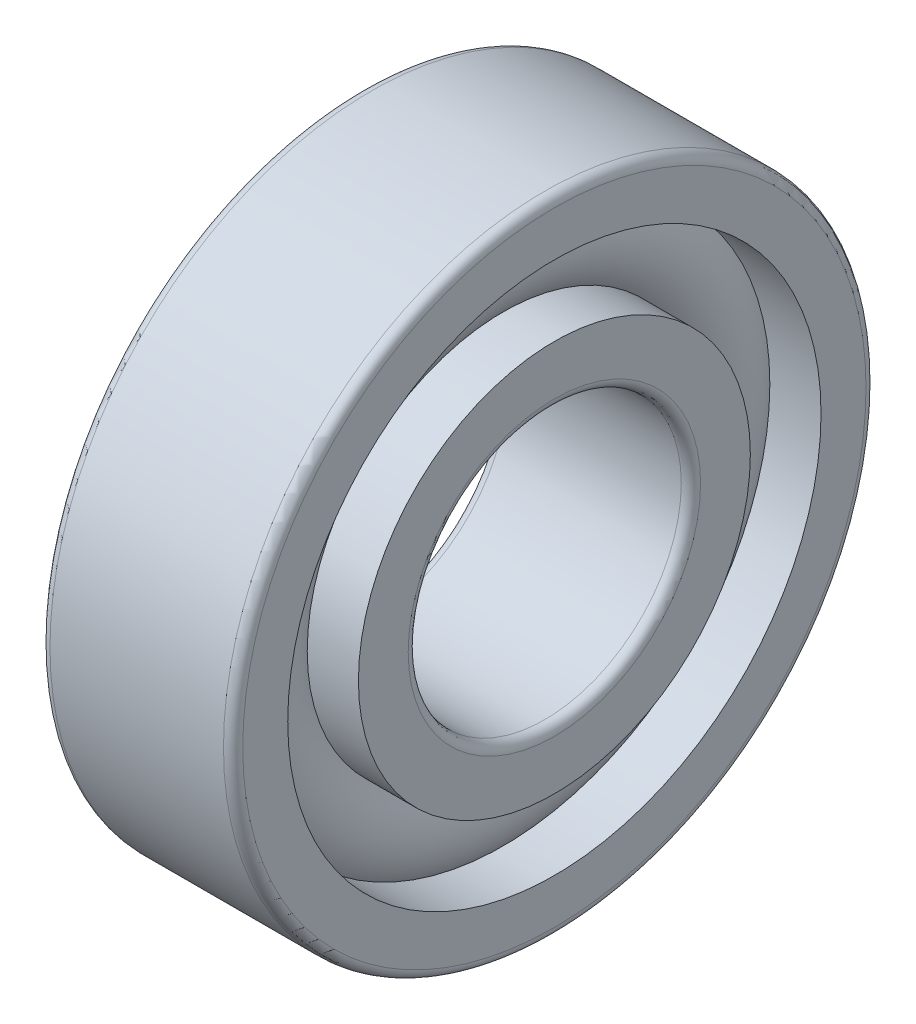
ISO-10303-21;
HEADER;
FILE_DESCRIPTION(('STEP AP214'),'2;1');
FILE_NAME('part.step','',(''),(''),'','','');
FILE_SCHEMA(('AUTOMOTIVE_DESIGN { 1 0 10303 214 1 1 1 1 }'));
ENDSEC;
DATA;
#1=APPLICATION_CONTEXT('core data for automotive mechanical design processes');
#2=APPLICATION_PROTOCOL_DEFINITION('international standard','automotive_design',2000,#1);
#3=PRODUCT_CONTEXT('',#1,'mechanical');
#4=PRODUCT('Part','Part','',(#3));
#5=PRODUCT_RELATED_PRODUCT_CATEGORY('part','',(#4));
#6=PRODUCT_DEFINITION_FORMATION('','',#4);
#7=PRODUCT_DEFINITION_CONTEXT('part definition',#1,'design');
#8=PRODUCT_DEFINITION('design','',#6,#7);
#9=PRODUCT_DEFINITION_SHAPE('','',#8);
#10=(LENGTH_UNIT() NAMED_UNIT(*) SI_UNIT(.MILLI.,.METRE.));
#11=(NAMED_UNIT(*) PLANE_ANGLE_UNIT() SI_UNIT($,.RADIAN.));
#12=(NAMED_UNIT(*) SI_UNIT($,.STERADIAN.) SOLID_ANGLE_UNIT());
#13=UNCERTAINTY_MEASURE_WITH_UNIT(LENGTH_MEASURE(1.E-05),#10,'distance_accuracy_value','');
#14=(GEOMETRIC_REPRESENTATION_CONTEXT(3) GLOBAL_UNCERTAINTY_ASSIGNED_CONTEXT((#13)) GLOBAL_UNIT_ASSIGNED_CONTEXT((#10,
#11,#12)) REPRESENTATION_CONTEXT('',''));
#15=CARTESIAN_POINT('',(0.,0.,0.));
#16=DIRECTION('',(0.,0.,1.));
#17=DIRECTION('',(1.,0.,0.));
#18=AXIS2_PLACEMENT_3D('',#15,#16,#17);
#19=CARTESIAN_POINT('',(1.97118869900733,0.,0.));
#20=DIRECTION('',(1.,0.,0.));
#21=DIRECTION('',(0.,0.,-1.));
#22=AXIS2_PLACEMENT_3D('',#19,#20,#21);
#23=TOROIDAL_SURFACE('',#22,16.7999999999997,0.199999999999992);
#24=CARTESIAN_POINT('',(1.77196728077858,0.,0.));
#25=DIRECTION('',(-1.,0.,0.));
#26=DIRECTION('',(0.,0.,1.));
#27=AXIS2_PLACEMENT_3D('',#24,#25,#26);
#28=CIRCLE('',#27,16.782369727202);
#29=CARTESIAN_POINT('',(1.77196728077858,0.,16.782369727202));
#30=VERTEX_POINT('',#29);
#31=EDGE_CURVE('E491',#30,#30,#28,.T.);
#32=ORIENTED_EDGE('',*,*,#31,.T.);
#33=EDGE_LOOP('',(#32));
#34=FACE_BOUND('',#33,.T.);
#35=CARTESIAN_POINT('',(1.9711883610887,0.,0.));
#36=DIRECTION('',(-1.,0.,0.));
#37=DIRECTION('',(0.,0.,1.));
#38=AXIS2_PLACEMENT_3D('',#35,#36,#37);
#39=CIRCLE('',#38,16.6);
#40=CARTESIAN_POINT('',(1.9711883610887,0.,16.6));
#41=VERTEX_POINT('',#40);
#42=EDGE_CURVE('E488',#41,#41,#39,.F.);
#43=ORIENTED_EDGE('',*,*,#42,.T.);
#44=EDGE_LOOP('',(#43));
#45=FACE_BOUND('',#44,.T.);
#46=ADVANCED_FACE('F14',(#34,#45),#23,.T.);
#47=CARTESIAN_POINT('',(1.742,0.,0.));
#48=DIRECTION('',(-1.,0.,0.));
#49=DIRECTION('',(0.,0.,1.));
#50=AXIS2_PLACEMENT_3D('',#47,#48,#49);
#51=CONICAL_SURFACE('',#50,17.121,1.48253068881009);
#52=CARTESIAN_POINT('',(1.742,0.,0.));
#53=DIRECTION('',(-1.,0.,0.));
#54=DIRECTION('',(0.,0.,1.));
#55=AXIS2_PLACEMENT_3D('',#52,#53,#54);
#56=CIRCLE('',#55,17.121);
#57=CARTESIAN_POINT('',(1.742,0.,17.121));
#58=VERTEX_POINT('',#57);
#59=EDGE_CURVE('E18',#58,#58,#56,.F.);
#60=ORIENTED_EDGE('',*,*,#59,.F.);
#61=EDGE_LOOP('',(#60));
#62=FACE_BOUND('',#61,.T.);
#63=ORIENTED_EDGE('',*,*,#31,.F.);
#64=EDGE_LOOP('',(#63));
#65=FACE_BOUND('',#64,.T.);
#66=ADVANCED_FACE('F426',(#62,#65),#51,.F.);
#67=CARTESIAN_POINT('',(11.4,0.,0.));
#68=DIRECTION('',(-1.,0.,0.));
#69=DIRECTION('',(0.,0.,1.));
#70=AXIS2_PLACEMENT_3D('',#67,#68,#69);
#71=CYLINDRICAL_SURFACE('',#70,16.6);
#72=ORIENTED_EDGE('',*,*,#42,.F.);
#73=EDGE_LOOP('',(#72));
#74=FACE_BOUND('',#73,.T.);
#75=CARTESIAN_POINT('',(3.186,0.,0.));
#76=DIRECTION('',(1.,0.,0.));
#77=DIRECTION('',(0.,0.,-1.));
#78=AXIS2_PLACEMENT_3D('',#75,#76,#77);
#79=CIRCLE('',#78,16.6);
#80=CARTESIAN_POINT('',(3.186,0.,-16.6));
#81=VERTEX_POINT('',#80);
#82=EDGE_CURVE('E411',#81,#81,#79,.F.);
#83=ORIENTED_EDGE('',*,*,#82,.F.);
#84=EDGE_LOOP('',(#83));
#85=FACE_BOUND('',#84,.T.);
#86=ADVANCED_FACE('F423',(#74,#85),#71,.F.);
#87=CARTESIAN_POINT('',(1.742,16.25,0.));
#88=DIRECTION('',(1.,0.,0.));
#89=DIRECTION('',(0.,0.,-1.));
#90=AXIS2_PLACEMENT_3D('',#87,#88,#89);
#91=PLANE('',#90);
#92=CARTESIAN_POINT('',(1.742,0.,0.));
#93=DIRECTION('',(1.,0.,0.));
#94=DIRECTION('',(0.,1.,0.));
#95=AXIS2_PLACEMENT_3D('',#92,#93,#94);
#96=CIRCLE('',#95,16.25);
#97=CARTESIAN_POINT('',(1.742,16.25,0.));
#98=VERTEX_POINT('',#97);
#99=EDGE_CURVE('E406',#98,#98,#96,.F.);
#100=ORIENTED_EDGE('',*,*,#99,.T.);
#101=EDGE_LOOP('',(#100));
#102=FACE_BOUND('',#101,.T.);
#103=ORIENTED_EDGE('',*,*,#59,.T.);
#104=EDGE_LOOP('',(#103));
#105=FACE_BOUND('',#104,.T.);
#106=ADVANCED_FACE('F419',(#102,#105),#91,.T.);
#107=CARTESIAN_POINT('',(6.0001044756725,0.,0.));
#108=DIRECTION('',(1.,0.,0.));
#109=DIRECTION('',(0.,0.,-1.));
#110=AXIS2_PLACEMENT_3D('',#107,#108,#109);
#111=TOROIDAL_SURFACE('',#110,14.4,3.572);
#112=ORIENTED_EDGE('',*,*,#82,.T.);
#113=EDGE_LOOP('',(#112));
#114=FACE_BOUND('',#113,.T.);
#115=CARTESIAN_POINT('',(3.186,0.,0.));
#116=DIRECTION('',(-1.,0.,0.));
#117=DIRECTION('',(0.,0.,1.));
#118=AXIS2_PLACEMENT_3D('',#115,#116,#117);
#119=CIRCLE('',#118,12.2);
#120=CARTESIAN_POINT('',(3.186,0.,12.2));
#121=VERTEX_POINT('',#120);
#122=EDGE_CURVE('E403',#121,#121,#119,.T.);
#123=ORIENTED_EDGE('',*,*,#122,.F.);
#124=EDGE_LOOP('',(#123));
#125=FACE_BOUND('',#124,.T.);
#126=ADVANCED_FACE('F414',(#114,#125),#111,.T.);
#127=CARTESIAN_POINT('',(1.742,0.,0.));
#128=DIRECTION('',(1.,0.,0.));
#129=DIRECTION('',(0.,1.,0.));
#130=AXIS2_PLACEMENT_3D('',#127,#128,#129);
#131=CONICAL_SURFACE('',#130,16.25,0.785398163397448);
#132=CARTESIAN_POINT('',(0.642,0.,0.));
#133=DIRECTION('',(1.,0.,0.));
#134=DIRECTION('',(0.,1.,0.));
#135=AXIS2_PLACEMENT_3D('',#132,#133,#134);
#136=CIRCLE('',#135,15.15);
#137=CARTESIAN_POINT('',(0.642,15.15,0.));
#138=VERTEX_POINT('',#137);
#139=EDGE_CURVE('E400',#138,#138,#136,.T.);
#140=ORIENTED_EDGE('',*,*,#139,.F.);
#141=EDGE_LOOP('',(#140));
#142=FACE_BOUND('',#141,.T.);
#143=ORIENTED_EDGE('',*,*,#99,.F.);
#144=EDGE_LOOP('',(#143));
#145=FACE_BOUND('',#144,.T.);
#146=ADVANCED_FACE('F418',(#142,#145),#131,.F.);
#147=CARTESIAN_POINT('',(11.4,0.,0.));
#148=DIRECTION('',(-1.,0.,0.));
#149=DIRECTION('',(0.,0.,1.));
#150=AXIS2_PLACEMENT_3D('',#147,#148,#149);
#151=CYLINDRICAL_SURFACE('',#150,12.2);
#152=ORIENTED_EDGE('',*,*,#122,.T.);
#153=EDGE_LOOP('',(#152));
#154=FACE_BOUND('',#153,.T.);
#155=CARTESIAN_POINT('',(1.94508565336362,0.,0.));
#156=DIRECTION('',(1.,0.,0.));
#157=DIRECTION('',(0.,0.,-1.));
#158=AXIS2_PLACEMENT_3D('',#155,#156,#157);
#159=CIRCLE('',#158,12.2000000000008);
#160=CARTESIAN_POINT('',(1.94508565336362,0.,-12.2000000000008));
#161=VERTEX_POINT('',#160);
#162=EDGE_CURVE('E396',#161,#161,#159,.F.);
#163=ORIENTED_EDGE('',*,*,#162,.F.);
#164=EDGE_LOOP('',(#163));
#165=FACE_BOUND('',#164,.T.);
#166=ADVANCED_FACE('F506',(#154,#165),#151,.T.);
#167=CARTESIAN_POINT('',(0.642,12.1,0.));
#168=DIRECTION('',(1.,0.,0.));
#169=DIRECTION('',(0.,0.,-1.));
#170=AXIS2_PLACEMENT_3D('',#167,#168,#169);
#171=PLANE('',#170);
#172=CARTESIAN_POINT('',(0.642,0.,0.));
#173=DIRECTION('',(-1.,0.,0.));
#174=DIRECTION('',(0.,0.,1.));
#175=AXIS2_PLACEMENT_3D('',#172,#173,#174);
#176=CIRCLE('',#175,12.1);
#177=CARTESIAN_POINT('',(0.642,0.,12.1));
#178=VERTEX_POINT('',#177);
#179=EDGE_CURVE('E399',#178,#178,#176,.F.);
#180=ORIENTED_EDGE('',*,*,#179,.F.);
#181=EDGE_LOOP('',(#180));
#182=FACE_BOUND('',#181,.T.);
#183=ORIENTED_EDGE('',*,*,#139,.T.);
#184=EDGE_LOOP('',(#183));
#185=FACE_BOUND('',#184,.T.);
#186=ADVANCED_FACE('F388',(#182,#185),#171,.T.);
#187=CARTESIAN_POINT('',(1.94508565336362,0.,0.));
#188=DIRECTION('',(1.,0.,0.));
#189=DIRECTION('',(0.,0.,-1.));
#190=AXIS2_PLACEMENT_3D('',#187,#188,#189);
#191=TOROIDAL_SURFACE('',#190,12.0000000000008,0.2);
#192=ORIENTED_EDGE('',*,*,#162,.T.);
#193=EDGE_LOOP('',(#192));
#194=FACE_BOUND('',#193,.T.);
#195=CARTESIAN_POINT('',(1.75715785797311,0.,0.));
#196=DIRECTION('',(1.,0.,0.));
#197=DIRECTION('',(0.,0.,-1.));
#198=AXIS2_PLACEMENT_3D('',#195,#196,#197);
#199=CIRCLE('',#198,12.0684334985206);
#200=CARTESIAN_POINT('',(1.75715785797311,0.,-12.0684334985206));
#201=VERTEX_POINT('',#200);
#202=EDGE_CURVE('E479',#201,#201,#199,.F.);
#203=ORIENTED_EDGE('',*,*,#202,.F.);
#204=EDGE_LOOP('',(#203));
#205=FACE_BOUND('',#204,.T.);
#206=ADVANCED_FACE('F383',(#194,#205),#191,.T.);
#207=CARTESIAN_POINT('',(11.4,0.,0.));
#208=DIRECTION('',(-1.,0.,0.));
#209=DIRECTION('',(0.,0.,1.));
#210=AXIS2_PLACEMENT_3D('',#207,#208,#209);
#211=CYLINDRICAL_SURFACE('',#210,12.1);
#212=CARTESIAN_POINT('',(1.162,0.,0.));
#213=DIRECTION('',(-1.,0.,0.));
#214=DIRECTION('',(0.,0.,1.));
#215=AXIS2_PLACEMENT_3D('',#212,#213,#214);
#216=CIRCLE('',#215,12.1);
#217=CARTESIAN_POINT('',(1.162,0.,12.1));
#218=VERTEX_POINT('',#217);
#219=EDGE_CURVE('E476',#218,#218,#216,.F.);
#220=ORIENTED_EDGE('',*,*,#219,.F.);
#221=EDGE_LOOP('',(#220));
#222=FACE_BOUND('',#221,.T.);
#223=ORIENTED_EDGE('',*,*,#179,.T.);
#224=EDGE_LOOP('',(#223));
#225=FACE_BOUND('',#224,.T.);
#226=ADVANCED_FACE('F379',(#222,#225),#211,.T.);
#227=CARTESIAN_POINT('',(1.75715785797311,0.,0.));
#228=DIRECTION('',(1.,0.,0.));
#229=DIRECTION('',(0.,1.,0.));
#230=AXIS2_PLACEMENT_3D('',#227,#228,#229);
#231=CONICAL_SURFACE('',#230,12.0684334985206,1.22157279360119);
#232=ORIENTED_EDGE('',*,*,#202,.T.);
#233=EDGE_LOOP('',(#232));
#234=FACE_BOUND('',#233,.T.);
#235=CARTESIAN_POINT('',(1.43420627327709,0.,0.));
#236=DIRECTION('',(1.,0.,0.));
#237=DIRECTION('',(0.,0.,-1.));
#238=AXIS2_PLACEMENT_3D('',#235,#236,#237);
#239=CIRCLE('',#238,11.1815664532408);
#240=CARTESIAN_POINT('',(1.43420627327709,0.,-11.1815664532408));
#241=VERTEX_POINT('',#240);
#242=EDGE_CURVE('E364',#241,#241,#239,.T.);
#243=ORIENTED_EDGE('',*,*,#242,.T.);
#244=EDGE_LOOP('',(#243));
#245=FACE_BOUND('',#244,.T.);
#246=ADVANCED_FACE('F375',(#234,#245),#231,.T.);
#247=CARTESIAN_POINT('',(1.162,11.8,0.));
#248=DIRECTION('',(1.,0.,0.));
#249=DIRECTION('',(0.,0.,-1.));
#250=AXIS2_PLACEMENT_3D('',#247,#248,#249);
#251=PLANE('',#250);
#252=CARTESIAN_POINT('',(1.162,0.,0.));
#253=DIRECTION('',(-1.,0.,0.));
#254=DIRECTION('',(0.,0.,1.));
#255=AXIS2_PLACEMENT_3D('',#252,#253,#254);
#256=CIRCLE('',#255,11.8);
#257=CARTESIAN_POINT('',(1.162,0.,11.8));
#258=VERTEX_POINT('',#257);
#259=EDGE_CURVE('E359',#258,#258,#256,.T.);
#260=ORIENTED_EDGE('',*,*,#259,.T.);
#261=EDGE_LOOP('',(#260));
#262=FACE_BOUND('',#261,.T.);
#263=ORIENTED_EDGE('',*,*,#219,.T.);
#264=EDGE_LOOP('',(#263));
#265=FACE_BOUND('',#264,.T.);
#266=ADVANCED_FACE('F371',(#262,#265),#251,.T.);
#267=CARTESIAN_POINT('',(1.24627849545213,0.,0.));
#268=DIRECTION('',(1.,0.,0.));
#269=DIRECTION('',(0.,0.,-1.));
#270=AXIS2_PLACEMENT_3D('',#267,#268,#269);
#271=TOROIDAL_SURFACE('',#270,11.249999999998,0.199999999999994);
#272=CARTESIAN_POINT('',(1.2462793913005,0.,0.));
#273=DIRECTION('',(-1.,0.,0.));
#274=DIRECTION('',(0.,0.,1.));
#275=AXIS2_PLACEMENT_3D('',#272,#273,#274);
#276=CIRCLE('',#275,11.05);
#277=CARTESIAN_POINT('',(1.2462793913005,0.,11.05));
#278=VERTEX_POINT('',#277);
#279=EDGE_CURVE('E346',#278,#278,#276,.T.);
#280=ORIENTED_EDGE('',*,*,#279,.F.);
#281=EDGE_LOOP('',(#280));
#282=FACE_BOUND('',#281,.T.);
#283=ORIENTED_EDGE('',*,*,#242,.F.);
#284=EDGE_LOOP('',(#283));
#285=FACE_BOUND('',#284,.T.);
#286=ADVANCED_FACE('F367',(#282,#285),#271,.F.);
#287=CARTESIAN_POINT('',(11.4,0.,0.));
#288=DIRECTION('',(-1.,0.,0.));
#289=DIRECTION('',(0.,0.,1.));
#290=AXIS2_PLACEMENT_3D('',#287,#288,#289);
#291=CYLINDRICAL_SURFACE('',#290,11.8);
#292=CARTESIAN_POINT('',(0.642,0.,0.));
#293=DIRECTION('',(1.,0.,0.));
#294=DIRECTION('',(0.,0.,-1.));
#295=AXIS2_PLACEMENT_3D('',#292,#293,#294);
#296=CIRCLE('',#295,11.8);
#297=CARTESIAN_POINT('',(0.642,0.,-11.8));
#298=VERTEX_POINT('',#297);
#299=EDGE_CURVE('E342',#298,#298,#296,.T.);
#300=ORIENTED_EDGE('',*,*,#299,.F.);
#301=EDGE_LOOP('',(#300));
#302=FACE_BOUND('',#301,.T.);
#303=ORIENTED_EDGE('',*,*,#259,.F.);
#304=EDGE_LOOP('',(#303));
#305=FACE_BOUND('',#304,.T.);
#306=ADVANCED_FACE('F370',(#302,#305),#291,.F.);
#307=CARTESIAN_POINT('',(11.4,0.,0.));
#308=DIRECTION('',(-1.,0.,0.));
#309=DIRECTION('',(0.,0.,1.));
#310=AXIS2_PLACEMENT_3D('',#307,#308,#309);
#311=CYLINDRICAL_SURFACE('',#310,11.05);
#312=ORIENTED_EDGE('',*,*,#279,.T.);
#313=EDGE_LOOP('',(#312));
#314=FACE_BOUND('',#313,.T.);
#315=CARTESIAN_POINT('',(1.071,0.,0.));
#316=DIRECTION('',(1.,0.,0.));
#317=DIRECTION('',(0.,0.,-1.));
#318=AXIS2_PLACEMENT_3D('',#315,#316,#317);
#319=CIRCLE('',#318,11.05);
#320=CARTESIAN_POINT('',(1.071,0.,-11.05));
#321=VERTEX_POINT('',#320);
#322=EDGE_CURVE('E345',#321,#321,#319,.T.);
#323=ORIENTED_EDGE('',*,*,#322,.T.);
#324=EDGE_LOOP('',(#323));
#325=FACE_BOUND('',#324,.T.);
#326=ADVANCED_FACE('F334',(#314,#325),#311,.T.);
#327=CARTESIAN_POINT('',(0.642,0.,0.));
#328=DIRECTION('',(1.,0.,0.));
#329=DIRECTION('',(0.,0.,-1.));
#330=AXIS2_PLACEMENT_3D('',#327,#328,#329);
#331=TOROIDAL_SURFACE('',#330,12.1,0.3);
#332=CARTESIAN_POINT('',(0.342,0.,0.));
#333=DIRECTION('',(-1.,0.,0.));
#334=DIRECTION('',(0.,0.,-1.));
#335=AXIS2_PLACEMENT_3D('',#332,#333,#334);
#336=CIRCLE('',#335,12.1);
#337=CARTESIAN_POINT('',(0.342,0.,-12.1));
#338=VERTEX_POINT('',#337);
#339=EDGE_CURVE('E299',#338,#338,#336,.F.);
#340=ORIENTED_EDGE('',*,*,#339,.F.);
#341=EDGE_LOOP('',(#340));
#342=FACE_BOUND('',#341,.T.);
#343=ORIENTED_EDGE('',*,*,#299,.T.);
#344=EDGE_LOOP('',(#343));
#345=FACE_BOUND('',#344,.T.);
#346=ADVANCED_FACE('F328',(#342,#345),#331,.T.);
#347=CARTESIAN_POINT('',(1.06984192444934,0.,0.));
#348=DIRECTION('',(1.,0.,0.));
#349=DIRECTION('',(0.,0.,-1.));
#350=AXIS2_PLACEMENT_3D('',#347,#348,#349);
#351=TOROIDAL_SURFACE('',#350,11.2499966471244,0.2);
#352=CARTESIAN_POINT('',(0.916429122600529,0.,0.));
#353=DIRECTION('',(-1.,0.,0.));
#354=DIRECTION('',(0.,0.,1.));
#355=AXIS2_PLACEMENT_3D('',#352,#353,#354);
#356=CIRCLE('',#355,11.1216825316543);
#357=CARTESIAN_POINT('',(0.91642912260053,0.,11.1216825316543));
#358=VERTEX_POINT('',#357);
#359=EDGE_CURVE('E296',#358,#358,#356,.T.);
#360=ORIENTED_EDGE('',*,*,#359,.F.);
#361=EDGE_LOOP('',(#360));
#362=FACE_BOUND('',#361,.T.);
#363=ORIENTED_EDGE('',*,*,#322,.F.);
#364=EDGE_LOOP('',(#363));
#365=FACE_BOUND('',#364,.T.);
#366=ADVANCED_FACE('F323',(#362,#365),#351,.F.);
#367=CARTESIAN_POINT('',(0.342,15.274,0.));
#368=DIRECTION('',(-1.,0.,0.));
#369=DIRECTION('',(0.,0.,1.));
#370=AXIS2_PLACEMENT_3D('',#367,#368,#369);
#371=PLANE('',#370);
#372=CARTESIAN_POINT('',(0.342,0.,0.));
#373=DIRECTION('',(1.,0.,0.));
#374=DIRECTION('',(0.,0.,-1.));
#375=AXIS2_PLACEMENT_3D('',#372,#373,#374);
#376=CIRCLE('',#375,15.274);
#377=CARTESIAN_POINT('',(0.342,0.,-15.274));
#378=VERTEX_POINT('',#377);
#379=EDGE_CURVE('E293',#378,#378,#376,.T.);
#380=ORIENTED_EDGE('',*,*,#379,.F.);
#381=EDGE_LOOP('',(#380));
#382=FACE_BOUND('',#381,.T.);
#383=ORIENTED_EDGE('',*,*,#339,.T.);
#384=EDGE_LOOP('',(#383));
#385=FACE_BOUND('',#384,.T.);
#386=ADVANCED_FACE('F312',(#382,#385),#371,.T.);
#387=CARTESIAN_POINT('',(0.600000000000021,0.,0.));
#388=DIRECTION('',(-1.,0.,0.));
#389=DIRECTION('',(0.,0.,1.));
#390=AXIS2_PLACEMENT_3D('',#387,#388,#389);
#391=CONICAL_SURFACE('',#390,11.5,0.874244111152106);
#392=ORIENTED_EDGE('',*,*,#359,.T.);
#393=EDGE_LOOP('',(#392));
#394=FACE_BOUND('',#393,.T.);
#395=CARTESIAN_POINT('',(0.6,0.,0.));
#396=DIRECTION('',(-1.,0.,0.));
#397=DIRECTION('',(0.,0.,1.));
#398=AXIS2_PLACEMENT_3D('',#395,#396,#397);
#399=CIRCLE('',#398,11.5);
#400=CARTESIAN_POINT('',(0.6,0.,11.5));
#401=VERTEX_POINT('',#400);
#402=EDGE_CURVE('E288',#401,#401,#399,.T.);
#403=ORIENTED_EDGE('',*,*,#402,.F.);
#404=EDGE_LOOP('',(#403));
#405=FACE_BOUND('',#404,.T.);
#406=ADVANCED_FACE('F322',(#394,#405),#391,.T.);
#407=CARTESIAN_POINT('',(1.442,0.,0.));
#408=DIRECTION('',(1.,0.,0.));
#409=DIRECTION('',(0.,0.,-1.));
#410=AXIS2_PLACEMENT_3D('',#407,#408,#409);
#411=CONICAL_SURFACE('',#410,16.374,0.785398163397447);
#412=CARTESIAN_POINT('',(1.442,0.,0.));
#413=DIRECTION('',(-1.,0.,0.));
#414=DIRECTION('',(0.,0.,1.));
#415=AXIS2_PLACEMENT_3D('',#412,#413,#414);
#416=CIRCLE('',#415,16.374);
#417=CARTESIAN_POINT('',(1.442,0.,16.374));
#418=VERTEX_POINT('',#417);
#419=EDGE_CURVE('E271',#418,#418,#416,.T.);
#420=ORIENTED_EDGE('',*,*,#419,.T.);
#421=EDGE_LOOP('',(#420));
#422=FACE_BOUND('',#421,.T.);
#423=ORIENTED_EDGE('',*,*,#379,.T.);
#424=EDGE_LOOP('',(#423));
#425=FACE_BOUND('',#424,.T.);
#426=ADVANCED_FACE('F684',(#422,#425),#411,.T.);
#427=CARTESIAN_POINT('',(11.4,0.,0.));
#428=DIRECTION('',(-1.,0.,0.));
#429=DIRECTION('',(0.,0.,1.));
#430=AXIS2_PLACEMENT_3D('',#427,#428,#429);
#431=CYLINDRICAL_SURFACE('',#430,11.5);
#432=ORIENTED_EDGE('',*,*,#402,.T.);
#433=EDGE_LOOP('',(#432));
#434=FACE_BOUND('',#433,.T.);
#435=CARTESIAN_POINT('',(0.2,0.,0.));
#436=DIRECTION('',(1.,0.,0.));
#437=DIRECTION('',(0.,0.,-1.));
#438=AXIS2_PLACEMENT_3D('',#435,#436,#437);
#439=CIRCLE('',#438,11.5);
#440=CARTESIAN_POINT('',(0.2,0.,-11.5));
#441=VERTEX_POINT('',#440);
#442=EDGE_CURVE('E268',#441,#441,#439,.F.);
#443=ORIENTED_EDGE('',*,*,#442,.F.);
#444=EDGE_LOOP('',(#443));
#445=FACE_BOUND('',#444,.T.);
#446=ADVANCED_FACE('F674',(#434,#445),#431,.T.);
#447=CARTESIAN_POINT('',(1.39199535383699,0.,0.));
#448=DIRECTION('',(-1.,0.,0.));
#449=DIRECTION('',(0.,0.,1.));
#450=AXIS2_PLACEMENT_3D('',#447,#448,#449);
#451=CONICAL_SURFACE('',#450,17.723125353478,1.53374879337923);
#452=CARTESIAN_POINT('',(1.39199535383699,0.,0.));
#453=DIRECTION('',(1.,0.,0.));
#454=DIRECTION('',(0.,0.,-1.));
#455=AXIS2_PLACEMENT_3D('',#452,#453,#454);
#456=CIRCLE('',#455,17.723125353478);
#457=CARTESIAN_POINT('',(1.39199535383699,0.,-17.723125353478));
#458=VERTEX_POINT('',#457);
#459=EDGE_CURVE('E247',#458,#458,#456,.F.);
#460=ORIENTED_EDGE('',*,*,#459,.T.);
#461=EDGE_LOOP('',(#460));
#462=FACE_BOUND('',#461,.T.);
#463=ORIENTED_EDGE('',*,*,#419,.F.);
#464=EDGE_LOOP('',(#463));
#465=FACE_BOUND('',#464,.T.);
#466=ADVANCED_FACE('F261',(#462,#465),#451,.F.);
#467=CARTESIAN_POINT('',(0.2,0.,0.));
#468=DIRECTION('',(1.,0.,0.));
#469=DIRECTION('',(0.,0.,-1.));
#470=AXIS2_PLACEMENT_3D('',#467,#468,#469);
#471=TOROIDAL_SURFACE('',#470,11.3,0.2);
#472=ORIENTED_EDGE('',*,*,#442,.T.);
#473=EDGE_LOOP('',(#472));
#474=FACE_BOUND('',#473,.T.);
#475=CARTESIAN_POINT('',(0.,0.,0.));
#476=DIRECTION('',(1.,0.,0.));
#477=DIRECTION('',(0.,0.,-1.));
#478=AXIS2_PLACEMENT_3D('',#475,#476,#477);
#479=CIRCLE('',#478,11.3);
#480=CARTESIAN_POINT('',(0.,0.,-11.3));
#481=VERTEX_POINT('',#480);
#482=EDGE_CURVE('E277',#481,#481,#479,.F.);
#483=ORIENTED_EDGE('',*,*,#482,.F.);
#484=EDGE_LOOP('',(#483));
#485=FACE_BOUND('',#484,.T.);
#486=ADVANCED_FACE('F254',(#474,#485),#471,.T.);
#487=CARTESIAN_POINT('',(1.19213266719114,0.,0.));
#488=DIRECTION('',(1.,0.,0.));
#489=DIRECTION('',(0.,0.,-1.));
#490=AXIS2_PLACEMENT_3D('',#487,#488,#489);
#491=TOROIDAL_SURFACE('',#490,17.7157154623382,0.2);
#492=ORIENTED_EDGE('',*,*,#459,.F.);
#493=EDGE_LOOP('',(#492));
#494=FACE_BOUND('',#493,.T.);
#495=CARTESIAN_POINT('',(1.0284021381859,0.,0.));
#496=DIRECTION('',(1.,0.,0.));
#497=DIRECTION('',(0.,0.,-1.));
#498=AXIS2_PLACEMENT_3D('',#495,#496,#497);
#499=CIRCLE('',#498,17.8305732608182);
#500=CARTESIAN_POINT('',(1.0284021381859,0.,-17.8305732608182));
#501=VERTEX_POINT('',#500);
#502=EDGE_CURVE('E221',#501,#501,#499,.F.);
#503=ORIENTED_EDGE('',*,*,#502,.T.);
#504=EDGE_LOOP('',(#503));
#505=FACE_BOUND('',#504,.T.);
#506=ADVANCED_FACE('F250',(#494,#505),#491,.F.);
#507=CARTESIAN_POINT('',(0.,11.3,0.));
#508=DIRECTION('',(-1.,0.,0.));
#509=DIRECTION('',(0.,0.,1.));
#510=AXIS2_PLACEMENT_3D('',#507,#508,#509);
#511=PLANE('',#510);
#512=ORIENTED_EDGE('',*,*,#482,.T.);
#513=EDGE_LOOP('',(#512));
#514=FACE_BOUND('',#513,.T.);
#515=CARTESIAN_POINT('',(0.,0.,0.));
#516=DIRECTION('',(-1.,0.,0.));
#517=DIRECTION('',(0.,0.,-1.));
#518=AXIS2_PLACEMENT_3D('',#515,#516,#517);
#519=CIRCLE('',#518,9.1);
#520=CARTESIAN_POINT('',(0.,0.,-9.1));
#521=VERTEX_POINT('',#520);
#522=EDGE_CURVE('E216',#521,#521,#519,.T.);
#523=ORIENTED_EDGE('',*,*,#522,.F.);
#524=EDGE_LOOP('',(#523));
#525=FACE_BOUND('',#524,.T.);
#526=ADVANCED_FACE('F253',(#514,#525),#511,.T.);
#527=CARTESIAN_POINT('',(1.0284021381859,0.,0.));
#528=DIRECTION('',(1.,0.,0.));
#529=DIRECTION('',(0.,0.,-1.));
#530=AXIS2_PLACEMENT_3D('',#527,#528,#529);
#531=CONICAL_SURFACE('',#530,17.8305732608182,0.959069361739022);
#532=CARTESIAN_POINT('',(0.746,0.,0.));
#533=DIRECTION('',(-1.,0.,0.));
#534=DIRECTION('',(0.,0.,1.));
#535=AXIS2_PLACEMENT_3D('',#532,#533,#534);
#536=CIRCLE('',#535,17.428);
#537=CARTESIAN_POINT('',(0.745999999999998,0.,17.428));
#538=VERTEX_POINT('',#537);
#539=EDGE_CURVE('E211',#538,#538,#536,.F.);
#540=ORIENTED_EDGE('',*,*,#539,.F.);
#541=EDGE_LOOP('',(#540));
#542=FACE_BOUND('',#541,.T.);
#543=ORIENTED_EDGE('',*,*,#502,.F.);
#544=EDGE_LOOP('',(#543));
#545=FACE_BOUND('',#544,.T.);
#546=ADVANCED_FACE('F230',(#542,#545),#531,.F.);
#547=CARTESIAN_POINT('',(0.6,0.,0.));
#548=DIRECTION('',(1.,0.,0.));
#549=DIRECTION('',(0.,0.,-1.));
#550=AXIS2_PLACEMENT_3D('',#547,#548,#549);
#551=TOROIDAL_SURFACE('',#550,9.1,0.6);
#552=ORIENTED_EDGE('',*,*,#522,.T.);
#553=EDGE_LOOP('',(#552));
#554=FACE_BOUND('',#553,.T.);
#555=CARTESIAN_POINT('',(0.6,0.,0.));
#556=DIRECTION('',(-1.,0.,0.));
#557=DIRECTION('',(0.,0.,1.));
#558=AXIS2_PLACEMENT_3D('',#555,#556,#557);
#559=CIRCLE('',#558,8.5);
#560=CARTESIAN_POINT('',(0.6,0.,8.5));
#561=VERTEX_POINT('',#560);
#562=EDGE_CURVE('E206',#561,#561,#559,.F.);
#563=ORIENTED_EDGE('',*,*,#562,.T.);
#564=EDGE_LOOP('',(#563));
#565=FACE_BOUND('',#564,.T.);
#566=ADVANCED_FACE('F224',(#554,#565),#551,.T.);
#567=CARTESIAN_POINT('',(0.746,0.,0.));
#568=DIRECTION('',(-1.,0.,0.));
#569=DIRECTION('',(0.,-1.,0.));
#570=AXIS2_PLACEMENT_3D('',#567,#568,#569);
#571=CONICAL_SURFACE('',#570,17.428,0.614823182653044);
#572=CARTESIAN_POINT('',(0.991,0.,0.));
#573=DIRECTION('',(1.,0.,0.));
#574=DIRECTION('',(0.,0.,-1.));
#575=AXIS2_PLACEMENT_3D('',#572,#573,#574);
#576=CIRCLE('',#575,17.255);
#577=CARTESIAN_POINT('',(0.991,0.,-17.255));
#578=VERTEX_POINT('',#577);
#579=EDGE_CURVE('E198',#578,#578,#576,.F.);
#580=ORIENTED_EDGE('',*,*,#579,.T.);
#581=EDGE_LOOP('',(#580));
#582=FACE_BOUND('',#581,.T.);
#583=ORIENTED_EDGE('',*,*,#539,.T.);
#584=EDGE_LOOP('',(#583));
#585=FACE_BOUND('',#584,.T.);
#586=ADVANCED_FACE('F229',(#582,#585),#571,.T.);
#587=CARTESIAN_POINT('',(11.4,0.,0.));
#588=DIRECTION('',(-1.,0.,0.));
#589=DIRECTION('',(0.,0.,1.));
#590=AXIS2_PLACEMENT_3D('',#587,#588,#589);
#591=CYLINDRICAL_SURFACE('',#590,8.5);
#592=ORIENTED_EDGE('',*,*,#562,.F.);
#593=EDGE_LOOP('',(#592));
#594=FACE_BOUND('',#593,.T.);
#595=CARTESIAN_POINT('',(11.4,0.,0.));
#596=DIRECTION('',(1.,0.,0.));
#597=DIRECTION('',(0.,0.,-1.));
#598=AXIS2_PLACEMENT_3D('',#595,#596,#597);
#599=CIRCLE('',#598,8.5);
#600=CARTESIAN_POINT('',(11.4,0.,-8.5));
#601=VERTEX_POINT('',#600);
#602=EDGE_CURVE('E179',#601,#601,#599,.F.);
#603=ORIENTED_EDGE('',*,*,#602,.F.);
#604=EDGE_LOOP('',(#603));
#605=FACE_BOUND('',#604,.T.);
#606=ADVANCED_FACE('F609',(#594,#605),#591,.F.);
#607=CARTESIAN_POINT('',(0.991,0.,0.));
#608=DIRECTION('',(1.,0.,0.));
#609=DIRECTION('',(0.,0.,-1.));
#610=AXIS2_PLACEMENT_3D('',#607,#608,#609);
#611=CONICAL_SURFACE('',#610,17.255,0.958701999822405);
#612=CARTESIAN_POINT('',(0.819,0.,0.));
#613=DIRECTION('',(-1.,0.,0.));
#614=DIRECTION('',(0.,0.,1.));
#615=AXIS2_PLACEMENT_3D('',#612,#613,#614);
#616=CIRCLE('',#615,17.01);
#617=CARTESIAN_POINT('',(0.818999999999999,0.,17.01));
#618=VERTEX_POINT('',#617);
#619=EDGE_CURVE('E170',#618,#618,#616,.T.);
#620=ORIENTED_EDGE('',*,*,#619,.T.);
#621=EDGE_LOOP('',(#620));
#622=FACE_BOUND('',#621,.T.);
#623=ORIENTED_EDGE('',*,*,#579,.F.);
#624=EDGE_LOOP('',(#623));
#625=FACE_BOUND('',#624,.T.);
#626=ADVANCED_FACE('F189',(#622,#625),#611,.F.);
#627=CARTESIAN_POINT('',(11.4,0.,0.));
#628=DIRECTION('',(1.,0.,0.));
#629=DIRECTION('',(0.,0.,-1.));
#630=AXIS2_PLACEMENT_3D('',#627,#628,#629);
#631=TOROIDAL_SURFACE('',#630,9.1,0.6);
#632=ORIENTED_EDGE('',*,*,#602,.T.);
#633=EDGE_LOOP('',(#632));
#634=FACE_BOUND('',#633,.T.);
#635=CARTESIAN_POINT('',(12.,0.,0.));
#636=DIRECTION('',(1.,0.,0.));
#637=DIRECTION('',(0.,0.,-1.));
#638=AXIS2_PLACEMENT_3D('',#635,#636,#637);
#639=CIRCLE('',#638,9.1);
#640=CARTESIAN_POINT('',(12.,0.,-9.1));
#641=VERTEX_POINT('',#640);
#642=EDGE_CURVE('E178',#641,#641,#639,.F.);
#643=ORIENTED_EDGE('',*,*,#642,.F.);
#644=EDGE_LOOP('',(#643));
#645=FACE_BOUND('',#644,.T.);
#646=ADVANCED_FACE('F185',(#634,#645),#631,.T.);
#647=CARTESIAN_POINT('',(0.573534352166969,0.,0.));
#648=DIRECTION('',(-1.,0.,0.));
#649=DIRECTION('',(0.,-1.,0.));
#650=AXIS2_PLACEMENT_3D('',#647,#648,#649);
#651=CONICAL_SURFACE('',#650,17.1816263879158,0.610180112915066);
#652=CARTESIAN_POINT('',(0.573534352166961,0.,0.));
#653=DIRECTION('',(1.,0.,0.));
#654=DIRECTION('',(0.,0.,-1.));
#655=AXIS2_PLACEMENT_3D('',#652,#653,#654);
#656=CIRCLE('',#655,17.1816263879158);
#657=CARTESIAN_POINT('',(0.573534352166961,0.,-17.1816263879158));
#658=VERTEX_POINT('',#657);
#659=EDGE_CURVE('E148',#658,#658,#656,.T.);
#660=ORIENTED_EDGE('',*,*,#659,.F.);
#661=EDGE_LOOP('',(#660));
#662=FACE_BOUND('',#661,.T.);
#663=ORIENTED_EDGE('',*,*,#619,.F.);
#664=EDGE_LOOP('',(#663));
#665=FACE_BOUND('',#664,.T.);
#666=ADVANCED_FACE('F161',(#662,#665),#651,.F.);
#667=CARTESIAN_POINT('',(12.,9.1,0.));
#668=DIRECTION('',(1.,0.,0.));
#669=DIRECTION('',(0.,0.,-1.));
#670=AXIS2_PLACEMENT_3D('',#667,#668,#669);
#671=PLANE('',#670);
#672=ORIENTED_EDGE('',*,*,#642,.T.);
#673=EDGE_LOOP('',(#672));
#674=FACE_BOUND('',#673,.T.);
#675=CARTESIAN_POINT('',(12.,0.,0.));
#676=DIRECTION('',(-1.,0.,0.));
#677=DIRECTION('',(0.,0.,1.));
#678=AXIS2_PLACEMENT_3D('',#675,#676,#677);
#679=CIRCLE('',#678,12.2);
#680=CARTESIAN_POINT('',(12.,0.,12.2));
#681=VERTEX_POINT('',#680);
#682=EDGE_CURVE('E143',#681,#681,#679,.T.);
#683=ORIENTED_EDGE('',*,*,#682,.F.);
#684=EDGE_LOOP('',(#683));
#685=FACE_BOUND('',#684,.T.);
#686=ADVANCED_FACE('F156',(#674,#685),#671,.T.);
#687=CARTESIAN_POINT('',(0.745438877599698,0.,0.));
#688=DIRECTION('',(1.,0.,0.));
#689=DIRECTION('',(0.,0.,-1.));
#690=AXIS2_PLACEMENT_3D('',#687,#688,#689);
#691=TOROIDAL_SURFACE('',#690,17.4274898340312,0.3);
#692=CARTESIAN_POINT('',(0.499999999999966,0.,0.));
#693=DIRECTION('',(-1.,0.,0.));
#694=DIRECTION('',(0.,0.,1.));
#695=AXIS2_PLACEMENT_3D('',#692,#693,#694);
#696=CIRCLE('',#695,17.6);
#697=CARTESIAN_POINT('',(0.499999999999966,0.,17.6));
#698=VERTEX_POINT('',#697);
#699=EDGE_CURVE('E138',#698,#698,#696,.T.);
#700=ORIENTED_EDGE('',*,*,#699,.T.);
#701=EDGE_LOOP('',(#700));
#702=FACE_BOUND('',#701,.T.);
#703=ORIENTED_EDGE('',*,*,#659,.T.);
#704=EDGE_LOOP('',(#703));
#705=FACE_BOUND('',#704,.T.);
#706=ADVANCED_FACE('F151',(#702,#705),#691,.T.);
#707=CARTESIAN_POINT('',(11.4,0.,0.));
#708=DIRECTION('',(-1.,0.,0.));
#709=DIRECTION('',(0.,0.,1.));
#710=AXIS2_PLACEMENT_3D('',#707,#708,#709);
#711=CYLINDRICAL_SURFACE('',#710,12.2);
#712=ORIENTED_EDGE('',*,*,#682,.T.);
#713=EDGE_LOOP('',(#712));
#714=FACE_BOUND('',#713,.T.);
#715=CARTESIAN_POINT('',(8.814,0.,0.));
#716=DIRECTION('',(1.,0.,0.));
#717=DIRECTION('',(0.,0.,-1.));
#718=AXIS2_PLACEMENT_3D('',#715,#716,#717);
#719=CIRCLE('',#718,12.2);
#720=CARTESIAN_POINT('',(8.814,0.,-12.2));
#721=VERTEX_POINT('',#720);
#722=EDGE_CURVE('E135',#721,#721,#719,.F.);
#723=ORIENTED_EDGE('',*,*,#722,.F.);
#724=EDGE_LOOP('',(#723));
#725=FACE_BOUND('',#724,.T.);
#726=ADVANCED_FACE('F155',(#714,#725),#711,.T.);
#727=CARTESIAN_POINT('',(11.4,0.,0.));
#728=DIRECTION('',(-1.,0.,0.));
#729=DIRECTION('',(0.,0.,1.));
#730=AXIS2_PLACEMENT_3D('',#727,#728,#729);
#731=CYLINDRICAL_SURFACE('',#730,17.6);
#732=CARTESIAN_POINT('',(0.199999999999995,0.,0.));
#733=DIRECTION('',(1.,0.,0.));
#734=DIRECTION('',(0.,0.,-1.));
#735=AXIS2_PLACEMENT_3D('',#732,#733,#734);
#736=CIRCLE('',#735,17.6);
#737=CARTESIAN_POINT('',(0.199999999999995,0.,-17.6));
#738=VERTEX_POINT('',#737);
#739=EDGE_CURVE('E110',#738,#738,#736,.T.);
#740=ORIENTED_EDGE('',*,*,#739,.F.);
#741=EDGE_LOOP('',(#740));
#742=FACE_BOUND('',#741,.T.);
#743=ORIENTED_EDGE('',*,*,#699,.F.);
#744=EDGE_LOOP('',(#743));
#745=FACE_BOUND('',#744,.T.);
#746=ADVANCED_FACE('F582',(#742,#745),#731,.F.);
#747=CARTESIAN_POINT('',(5.9998955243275,0.,0.));
#748=DIRECTION('',(1.,0.,0.));
#749=DIRECTION('',(0.,0.,-1.));
#750=AXIS2_PLACEMENT_3D('',#747,#748,#749);
#751=TOROIDAL_SURFACE('',#750,14.4,3.572);
#752=ORIENTED_EDGE('',*,*,#722,.T.);
#753=EDGE_LOOP('',(#752));
#754=FACE_BOUND('',#753,.T.);
#755=CARTESIAN_POINT('',(8.814,0.,0.));
#756=DIRECTION('',(-1.,0.,0.));
#757=DIRECTION('',(0.,0.,1.));
#758=AXIS2_PLACEMENT_3D('',#755,#756,#757);
#759=CIRCLE('',#758,16.6);
#760=CARTESIAN_POINT('',(8.814,0.,16.6));
#761=VERTEX_POINT('',#760);
#762=EDGE_CURVE('E102',#761,#761,#759,.F.);
#763=ORIENTED_EDGE('',*,*,#762,.T.);
#764=EDGE_LOOP('',(#763));
#765=FACE_BOUND('',#764,.T.);
#766=ADVANCED_FACE('F120',(#754,#765),#751,.T.);
#767=CARTESIAN_POINT('',(0.199999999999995,0.,0.));
#768=DIRECTION('',(1.,0.,0.));
#769=DIRECTION('',(0.,0.,-1.));
#770=AXIS2_PLACEMENT_3D('',#767,#768,#769);
#771=TOROIDAL_SURFACE('',#770,17.8,0.199999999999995);
#772=CARTESIAN_POINT('',(0.,0.,0.));
#773=DIRECTION('',(-1.,0.,0.));
#774=DIRECTION('',(0.,0.,-1.));
#775=AXIS2_PLACEMENT_3D('',#772,#773,#774);
#776=CIRCLE('',#775,17.8);
#777=CARTESIAN_POINT('',(0.,0.,-17.8));
#778=VERTEX_POINT('',#777);
#779=EDGE_CURVE('E65',#778,#778,#776,.F.);
#780=ORIENTED_EDGE('',*,*,#779,.F.);
#781=EDGE_LOOP('',(#780));
#782=FACE_BOUND('',#781,.T.);
#783=ORIENTED_EDGE('',*,*,#739,.T.);
#784=EDGE_LOOP('',(#783));
#785=FACE_BOUND('',#784,.T.);
#786=ADVANCED_FACE('F116',(#782,#785),#771,.T.);
#787=CARTESIAN_POINT('',(11.4,0.,0.));
#788=DIRECTION('',(-1.,0.,0.));
#789=DIRECTION('',(0.,0.,1.));
#790=AXIS2_PLACEMENT_3D('',#787,#788,#789);
#791=CYLINDRICAL_SURFACE('',#790,16.6);
#792=ORIENTED_EDGE('',*,*,#762,.F.);
#793=EDGE_LOOP('',(#792));
#794=FACE_BOUND('',#793,.T.);
#795=CARTESIAN_POINT('',(12.,0.,0.));
#796=DIRECTION('',(-1.,0.,0.));
#797=DIRECTION('',(0.,0.,1.));
#798=AXIS2_PLACEMENT_3D('',#795,#796,#797);
#799=CIRCLE('',#798,16.6);
#800=CARTESIAN_POINT('',(12.,0.,16.6));
#801=VERTEX_POINT('',#800);
#802=EDGE_CURVE('E457',#801,#801,#799,.T.);
#803=ORIENTED_EDGE('',*,*,#802,.F.);
#804=EDGE_LOOP('',(#803));
#805=FACE_BOUND('',#804,.T.);
#806=ADVANCED_FACE('F82',(#794,#805),#791,.F.);
#807=CARTESIAN_POINT('',(0.,19.4,0.));
#808=DIRECTION('',(-1.,0.,0.));
#809=DIRECTION('',(0.,0.,1.));
#810=AXIS2_PLACEMENT_3D('',#807,#808,#809);
#811=PLANE('',#810);
#812=CARTESIAN_POINT('',(0.,0.,0.));
#813=DIRECTION('',(1.,0.,0.));
#814=DIRECTION('',(0.,0.,-1.));
#815=AXIS2_PLACEMENT_3D('',#812,#813,#814);
#816=CIRCLE('',#815,19.4);
#817=CARTESIAN_POINT('',(0.,0.,-19.4));
#818=VERTEX_POINT('',#817);
#819=EDGE_CURVE('E98',#818,#818,#816,.T.);
#820=ORIENTED_EDGE('',*,*,#819,.F.);
#821=EDGE_LOOP('',(#820));
#822=FACE_BOUND('',#821,.T.);
#823=ORIENTED_EDGE('',*,*,#779,.T.);
#824=EDGE_LOOP('',(#823));
#825=FACE_BOUND('',#824,.T.);
#826=ADVANCED_FACE('F72',(#822,#825),#811,.T.);
#827=CARTESIAN_POINT('',(12.,16.6,0.));
#828=DIRECTION('',(1.,0.,0.));
#829=DIRECTION('',(0.,0.,-1.));
#830=AXIS2_PLACEMENT_3D('',#827,#828,#829);
#831=PLANE('',#830);
#832=ORIENTED_EDGE('',*,*,#802,.T.);
#833=EDGE_LOOP('',(#832));
#834=FACE_BOUND('',#833,.T.);
#835=CARTESIAN_POINT('',(12.,0.,0.));
#836=DIRECTION('',(-1.,0.,0.));
#837=DIRECTION('',(0.,0.,-1.));
#838=AXIS2_PLACEMENT_3D('',#835,#836,#837);
#839=CIRCLE('',#838,19.4);
#840=CARTESIAN_POINT('',(12.,0.,-19.4));
#841=VERTEX_POINT('',#840);
#842=EDGE_CURVE('E27',#841,#841,#839,.T.);
#843=ORIENTED_EDGE('',*,*,#842,.F.);
#844=EDGE_LOOP('',(#843));
#845=FACE_BOUND('',#844,.T.);
#846=ADVANCED_FACE('F81',(#834,#845),#831,.T.);
#847=CARTESIAN_POINT('',(0.6,0.,0.));
#848=DIRECTION('',(1.,0.,0.));
#849=DIRECTION('',(0.,0.,-1.));
#850=AXIS2_PLACEMENT_3D('',#847,#848,#849);
#851=TOROIDAL_SURFACE('',#850,19.4,0.6);
#852=CARTESIAN_POINT('',(0.6,0.,0.));
#853=DIRECTION('',(-1.,0.,0.));
#854=DIRECTION('',(0.,0.,1.));
#855=AXIS2_PLACEMENT_3D('',#852,#853,#854);
#856=CIRCLE('',#855,20.);
#857=CARTESIAN_POINT('',(0.6,0.,20.));
#858=VERTEX_POINT('',#857);
#859=EDGE_CURVE('E22',#858,#858,#856,.F.);
#860=ORIENTED_EDGE('',*,*,#859,.F.);
#861=EDGE_LOOP('',(#860));
#862=FACE_BOUND('',#861,.T.);
#863=ORIENTED_EDGE('',*,*,#819,.T.);
#864=EDGE_LOOP('',(#863));
#865=FACE_BOUND('',#864,.T.);
#866=ADVANCED_FACE('F45',(#862,#865),#851,.T.);
#867=CARTESIAN_POINT('',(11.4,0.,0.));
#868=DIRECTION('',(1.,0.,0.));
#869=DIRECTION('',(0.,0.,-1.));
#870=AXIS2_PLACEMENT_3D('',#867,#868,#869);
#871=TOROIDAL_SURFACE('',#870,19.4,0.6);
#872=ORIENTED_EDGE('',*,*,#842,.T.);
#873=EDGE_LOOP('',(#872));
#874=FACE_BOUND('',#873,.T.);
#875=CARTESIAN_POINT('',(11.4,0.,0.));
#876=DIRECTION('',(-1.,0.,0.));
#877=DIRECTION('',(0.,0.,1.));
#878=AXIS2_PLACEMENT_3D('',#875,#876,#877);
#879=CIRCLE('',#878,20.);
#880=CARTESIAN_POINT('',(11.4,0.,20.));
#881=VERTEX_POINT('',#880);
#882=EDGE_CURVE('E10',#881,#881,#879,.T.);
#883=ORIENTED_EDGE('',*,*,#882,.F.);
#884=EDGE_LOOP('',(#883));
#885=FACE_BOUND('',#884,.T.);
#886=ADVANCED_FACE('F39',(#874,#885),#871,.T.);
#887=CARTESIAN_POINT('',(11.4,0.,0.));
#888=DIRECTION('',(-1.,0.,0.));
#889=DIRECTION('',(0.,0.,1.));
#890=AXIS2_PLACEMENT_3D('',#887,#888,#889);
#891=CYLINDRICAL_SURFACE('',#890,20.);
#892=ORIENTED_EDGE('',*,*,#882,.T.);
#893=EDGE_LOOP('',(#892));
#894=FACE_BOUND('',#893,.T.);
#895=ORIENTED_EDGE('',*,*,#859,.T.);
#896=EDGE_LOOP('',(#895));
#897=FACE_BOUND('',#896,.T.);
#898=ADVANCED_FACE('F44',(#894,#897),#891,.T.);
#899=CLOSED_SHELL('',(#46,#66,#86,#106,#126,#146,#166,#186,#206,#226,#246,#266,#286,#306,#326,
#346,#366,#386,#406,#426,#446,#466,#486,#506,#526,#546,#566,#586,#606,#626,#646,#666,#686,#706,
#726,#746,#766,#786,#806,#826,#846,#866,#886,#898));
#900=MANIFOLD_SOLID_BREP('B1',#899);
#901=ADVANCED_BREP_SHAPE_REPRESENTATION('',(#18,#900),#14);
#902=SHAPE_DEFINITION_REPRESENTATION(#9,#901);
ENDSEC;
END-ISO-10303-21;
